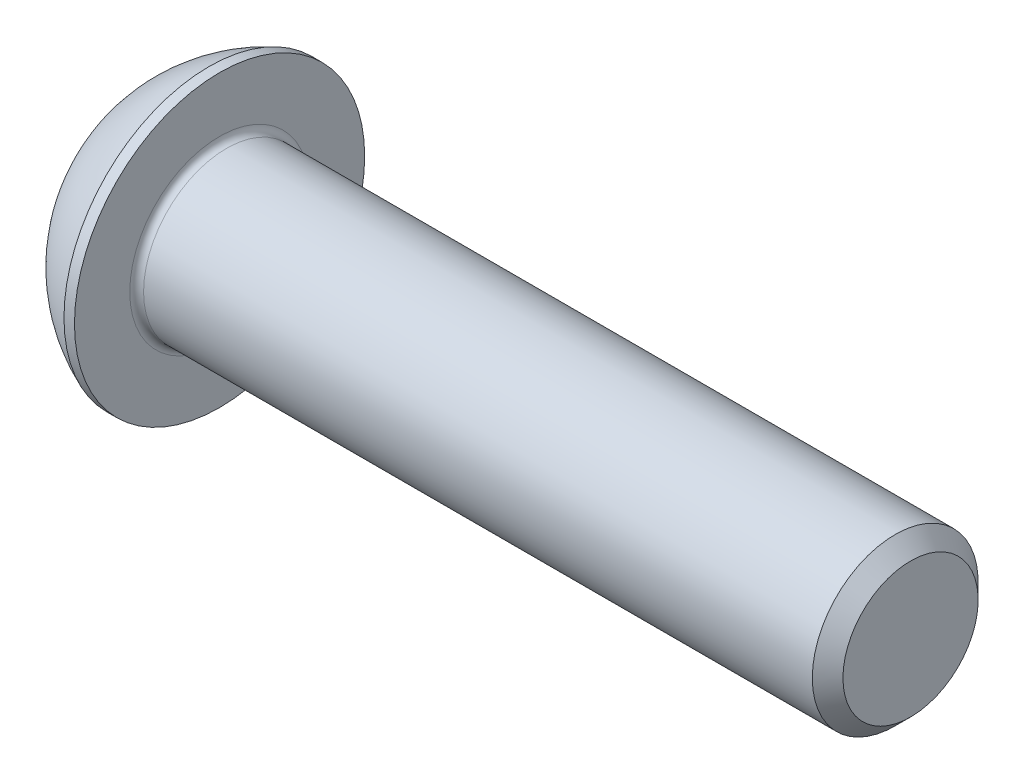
ISO-10303-21;
HEADER;
FILE_DESCRIPTION(('STEP AP214'),'2;1');
FILE_NAME('part.step','',(''),(''),'','','');
FILE_SCHEMA(('AUTOMOTIVE_DESIGN { 1 0 10303 214 1 1 1 1 }'));
ENDSEC;
DATA;
#1=APPLICATION_CONTEXT('core data for automotive mechanical design processes');
#2=APPLICATION_PROTOCOL_DEFINITION('international standard','automotive_design',2000,#1);
#3=PRODUCT_CONTEXT('',#1,'mechanical');
#4=PRODUCT('Part','Part','',(#3));
#5=PRODUCT_RELATED_PRODUCT_CATEGORY('part','',(#4));
#6=PRODUCT_DEFINITION_FORMATION('','',#4);
#7=PRODUCT_DEFINITION_CONTEXT('part definition',#1,'design');
#8=PRODUCT_DEFINITION('design','',#6,#7);
#9=PRODUCT_DEFINITION_SHAPE('','',#8);
#10=(LENGTH_UNIT() NAMED_UNIT(*) SI_UNIT(.MILLI.,.METRE.));
#11=(NAMED_UNIT(*) PLANE_ANGLE_UNIT() SI_UNIT($,.RADIAN.));
#12=(NAMED_UNIT(*) SI_UNIT($,.STERADIAN.) SOLID_ANGLE_UNIT());
#13=UNCERTAINTY_MEASURE_WITH_UNIT(LENGTH_MEASURE(1.E-05),#10,'distance_accuracy_value','');
#14=(GEOMETRIC_REPRESENTATION_CONTEXT(3) GLOBAL_UNCERTAINTY_ASSIGNED_CONTEXT((#13)) GLOBAL_UNIT_ASSIGNED_CONTEXT((#10,
#11,#12)) REPRESENTATION_CONTEXT('',''));
#15=CARTESIAN_POINT('',(0.,0.,0.));
#16=DIRECTION('',(0.,0.,1.));
#17=DIRECTION('',(1.,0.,0.));
#18=AXIS2_PLACEMENT_3D('',#15,#16,#17);
#19=CARTESIAN_POINT('',(0.,0.,0.));
#20=DIRECTION('',(-1.,0.,0.));
#21=DIRECTION('',(0.,0.,1.));
#22=AXIS2_PLACEMENT_3D('',#19,#20,#21);
#23=PLANE('',#22);
#24=CARTESIAN_POINT('',(0.,0.,0.));
#25=DIRECTION('',(-1.,0.,0.));
#26=DIRECTION('',(0.,0.,1.));
#27=AXIS2_PLACEMENT_3D('',#24,#25,#26);
#28=CIRCLE('',#27,2.625);
#29=CARTESIAN_POINT('',(0.,2.625,0.));
#30=VERTEX_POINT('',#29);
#31=EDGE_CURVE('E162',#30,#30,#28,.T.);
#32=ORIENTED_EDGE('',*,*,#31,.T.);
#33=EDGE_LOOP('',(#32));
#34=FACE_BOUND('',#33,.T.);
#35=DIRECTION('',(0.,-1.,0.));
#36=VECTOR('',#35,1.);
#37=CARTESIAN_POINT('',(0.,-1.15470053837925,2.));
#38=LINE('',#37,#36);
#39=CARTESIAN_POINT('',(0.,1.15470053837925,2.));
#40=VERTEX_POINT('',#39);
#41=CARTESIAN_POINT('',(0.,-1.15470053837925,2.));
#42=VERTEX_POINT('',#41);
#43=EDGE_CURVE('E52',#40,#42,#38,.T.);
#44=ORIENTED_EDGE('',*,*,#43,.T.);
#45=DIRECTION('',(0.,-0.5,-0.866025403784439));
#46=VECTOR('',#45,1.);
#47=CARTESIAN_POINT('',(0.,-2.3094010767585,0.));
#48=LINE('',#47,#46);
#49=CARTESIAN_POINT('',(0.,-2.3094010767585,0.));
#50=VERTEX_POINT('',#49);
#51=EDGE_CURVE('E255',#42,#50,#48,.T.);
#52=ORIENTED_EDGE('',*,*,#51,.T.);
#53=DIRECTION('',(0.,0.5,-0.866025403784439));
#54=VECTOR('',#53,1.);
#55=CARTESIAN_POINT('',(0.,-1.15470053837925,-2.));
#56=LINE('',#55,#54);
#57=CARTESIAN_POINT('',(0.,-1.15470053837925,-2.));
#58=VERTEX_POINT('',#57);
#59=EDGE_CURVE('E137',#50,#58,#56,.T.);
#60=ORIENTED_EDGE('',*,*,#59,.T.);
#61=DIRECTION('',(0.,1.,0.));
#62=VECTOR('',#61,1.);
#63=CARTESIAN_POINT('',(0.,1.15470053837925,-2.));
#64=LINE('',#63,#62);
#65=CARTESIAN_POINT('',(0.,1.15470053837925,-2.));
#66=VERTEX_POINT('',#65);
#67=EDGE_CURVE('E258',#58,#66,#64,.T.);
#68=ORIENTED_EDGE('',*,*,#67,.T.);
#69=DIRECTION('',(0.,0.5,0.866025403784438));
#70=VECTOR('',#69,1.);
#71=CARTESIAN_POINT('',(0.,2.3094010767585,0.));
#72=LINE('',#71,#70);
#73=CARTESIAN_POINT('',(0.,2.3094010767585,0.));
#74=VERTEX_POINT('',#73);
#75=EDGE_CURVE('E260',#66,#74,#72,.T.);
#76=ORIENTED_EDGE('',*,*,#75,.T.);
#77=DIRECTION('',(0.,-0.5,0.866025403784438));
#78=VECTOR('',#77,1.);
#79=CARTESIAN_POINT('',(0.,1.15470053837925,2.));
#80=LINE('',#79,#78);
#81=EDGE_CURVE('E262',#74,#40,#80,.T.);
#82=ORIENTED_EDGE('',*,*,#81,.T.);
#83=EDGE_LOOP('',(#44,#52,#60,#68,#76,#82));
#84=FACE_BOUND('',#83,.T.);
#85=ADVANCED_FACE('F37',(#34,#84),#23,.T.);
#86=CARTESIAN_POINT('',(4.99970462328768,0.,0.));
#87=DIRECTION('',(-1.,0.,0.));
#88=DIRECTION('',(0.,1.,0.));
#89=AXIS2_PLACEMENT_3D('',#86,#87,#88);
#90=SPHERICAL_SURFACE('',#89,5.64691697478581);
#91=CARTESIAN_POINT('',(2.92,0.,0.));
#92=DIRECTION('',(-1.,0.,0.));
#93=DIRECTION('',(0.,0.,1.));
#94=AXIS2_PLACEMENT_3D('',#91,#92,#93);
#95=CIRCLE('',#94,5.25);
#96=CARTESIAN_POINT('',(2.92,5.25,0.));
#97=VERTEX_POINT('',#96);
#98=EDGE_CURVE('E159',#97,#97,#95,.T.);
#99=CARTESIAN_POINT('',(2.92,5.25,0.));
#100=CARTESIAN_POINT('',(2.88116333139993,5.23461555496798,0.));
#101=CARTESIAN_POINT('',(2.84249743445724,5.21880002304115,0.));
#102=CARTESIAN_POINT('',(2.76552608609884,5.18631490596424,0.));
#103=CARTESIAN_POINT('',(2.72722063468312,5.16964532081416,0.));
#104=CARTESIAN_POINT('',(2.65098907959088,5.13546021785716,0.));
#105=CARTESIAN_POINT('',(2.61306297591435,5.11794470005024,0.));
#106=CARTESIAN_POINT('',(2.5376087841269,5.08207638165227,0.));
#107=CARTESIAN_POINT('',(2.50008069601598,5.06372358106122,0.));
#108=CARTESIAN_POINT('',(2.42544101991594,5.02618972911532,0.));
#109=CARTESIAN_POINT('',(2.38832943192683,5.00700867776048,0.));
#110=CARTESIAN_POINT('',(2.31454103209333,4.9678277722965,0.));
#111=CARTESIAN_POINT('',(2.27786422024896,4.94782791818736,0.));
#112=CARTESIAN_POINT('',(2.204963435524,4.90701925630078,0.));
#113=CARTESIAN_POINT('',(2.16873946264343,4.88621044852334,0.));
#114=CARTESIAN_POINT('',(2.09676219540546,4.84379412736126,0.));
#115=CARTESIAN_POINT('',(2.06100890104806,4.82218661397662,0.));
#116=CARTESIAN_POINT('',(1.9899905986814,4.77818352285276,0.));
#117=CARTESIAN_POINT('',(1.95472559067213,4.75578794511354,0.));
#118=CARTESIAN_POINT('',(1.88470122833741,4.7102197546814,0.));
#119=CARTESIAN_POINT('',(1.84994187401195,4.68704714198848,0.));
#120=CARTESIAN_POINT('',(1.78094593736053,4.63993629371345,0.));
#121=CARTESIAN_POINT('',(1.74670935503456,4.61599805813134,0.));
#122=CARTESIAN_POINT('',(1.67877582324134,4.56736775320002,0.));
#123=CARTESIAN_POINT('',(1.6450788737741,4.54267568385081,0.));
#124=CARTESIAN_POINT('',(1.57824120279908,4.4925498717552,0.));
#125=CARTESIAN_POINT('',(1.54510048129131,4.4671161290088,0.));
#126=CARTESIAN_POINT('',(1.4793915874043,4.4155194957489,0.));
#127=CARTESIAN_POINT('',(1.44682341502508,4.38935660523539,0.));
#128=CARTESIAN_POINT('',(1.3822756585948,4.33631456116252,0.));
#129=CARTESIAN_POINT('',(1.35029607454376,4.30943540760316,0.));
#130=CARTESIAN_POINT('',(1.28694124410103,4.2549740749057,0.));
#131=CARTESIAN_POINT('',(1.25556599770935,4.22739189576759,0.));
#132=CARTESIAN_POINT('',(1.19343529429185,4.17153809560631,0.));
#133=CARTESIAN_POINT('',(1.16267983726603,4.14326647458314,0.));
#134=CARTESIAN_POINT('',(1.10180385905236,4.0860477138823,0.));
#135=CARTESIAN_POINT('',(1.07168333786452,4.05710057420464,0.));
#136=CARTESIAN_POINT('',(1.01209206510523,3.99854503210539,0.));
#137=CARTESIAN_POINT('',(0.982621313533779,3.96893662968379,0.));
#138=CARTESIAN_POINT('',(0.924344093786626,3.90907314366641,0.));
#139=CARTESIAN_POINT('',(0.89553762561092,3.87881806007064,0.));
#140=CARTESIAN_POINT('',(0.838603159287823,3.8176761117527,0.));
#141=CARTESIAN_POINT('',(0.810475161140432,3.78678924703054,0.));
#142=CARTESIAN_POINT('',(0.754911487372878,3.72439894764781,0.));
#143=CARTESIAN_POINT('',(0.727475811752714,3.69289551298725,0.));
#144=CARTESIAN_POINT('',(0.673310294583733,3.62928758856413,0.));
#145=CARTESIAN_POINT('',(0.646580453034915,3.59718309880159,0.));
#146=CARTESIAN_POINT('',(0.59383976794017,3.53238887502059,0.));
#147=CARTESIAN_POINT('',(0.567828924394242,3.49969914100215,0.));
#148=CARTESIAN_POINT('',(0.516539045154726,3.43375052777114,0.));
#149=CARTESIAN_POINT('',(0.491260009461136,3.40049164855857,0.));
#150=CARTESIAN_POINT('',(0.441446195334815,3.33342112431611,0.));
#151=CARTESIAN_POINT('',(0.416911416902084,3.29960947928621,0.));
#152=CARTESIAN_POINT('',(0.368598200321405,3.23145007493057,0.));
#153=CARTESIAN_POINT('',(0.344819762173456,3.19710231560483,0.));
#154=CARTESIAN_POINT('',(0.298030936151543,3.12788759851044,0.));
#155=CARTESIAN_POINT('',(0.275020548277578,3.09302064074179,0.));
#156=CARTESIAN_POINT('',(0.229779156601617,3.02278469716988,0.));
#157=CARTESIAN_POINT('',(0.207548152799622,2.98741571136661,0.));
#158=CARTESIAN_POINT('',(0.163876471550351,2.91619313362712,0.));
#159=CARTESIAN_POINT('',(0.142435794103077,2.8803395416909,0.));
#160=CARTESIAN_POINT('',(0.100355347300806,2.80816539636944,0.));
#161=CARTESIAN_POINT('',(0.0797155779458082,2.7718448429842,0.));
#162=CARTESIAN_POINT('',(0.0392470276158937,2.69875470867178,0.));
#163=CARTESIAN_POINT('',(0.0194182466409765,2.66198512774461,0.));
#164=CARTESIAN_POINT('',(0.,2.625,0.));
#165=B_SPLINE_CURVE_WITH_KNOTS('',3,(#99,#100,#101,#102,#103,#104,#105,#106,#107,#108,#109,#110,
#111,#112,#113,#114,#115,#116,#117,#118,#119,#120,#121,#122,#123,#124,#125,#126,#127,#128,#129,
#130,#131,#132,#133,#134,#135,#136,#137,#138,#139,#140,#141,#142,#143,#144,#145,#146,#147,#148,
#149,#150,#151,#152,#153,#154,#155,#156,#157,#158,#159,#160,#161,#162,#163,#164),.UNSPECIFIED.,
.F.,.F.,(4,2,2,2,2,2,2,2,2,2,2,2,2,2,2,2,2,2,2,2,2,2,2,2,2,2,2,2,2,2,2,2,4),(0.,
0.12531586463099,0.25063172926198,0.37594759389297,0.50126345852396,0.626579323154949,
0.75189518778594,0.87721105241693,1.00252691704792,1.12784278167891,1.2531586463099,
1.37847451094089,1.50379037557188,1.62910624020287,1.75442210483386,1.87973796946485,
2.00505383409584,2.13036969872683,2.25568556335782,2.38100142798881,2.5063172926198,
2.63163315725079,2.75694902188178,2.88226488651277,3.00758075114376,3.13289661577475,
3.25821248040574,3.38352834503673,3.50884420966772,3.63416007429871,3.7594759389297,
3.88479180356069,4.01010766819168),.UNSPECIFIED.);
#166=EDGE_CURVE('BSEAM183',#97,#30,#165,.T.);
#167=ORIENTED_EDGE('',*,*,#98,.T.);
#168=ORIENTED_EDGE('',*,*,#31,.F.);
#169=ORIENTED_EDGE('',*,*,#166,.T.);
#170=ORIENTED_EDGE('',*,*,#166,.F.);
#171=EDGE_LOOP('',(#167,#169,#168,#170));
#172=FACE_BOUND('',#171,.T.);
#173=ADVANCED_FACE('F183',(#172),#90,.T.);
#174=CARTESIAN_POINT('',(0.,0.,0.));
#175=DIRECTION('',(-1.,0.,0.));
#176=DIRECTION('',(0.,0.,1.));
#177=AXIS2_PLACEMENT_3D('',#174,#175,#176);
#178=CYLINDRICAL_SURFACE('',#177,5.25);
#179=ORIENTED_EDGE('',*,*,#98,.F.);
#180=EDGE_LOOP('',(#179));
#181=FACE_BOUND('',#180,.T.);
#182=CARTESIAN_POINT('',(3.3,0.,0.));
#183=DIRECTION('',(-1.,0.,0.));
#184=DIRECTION('',(0.,0.,1.));
#185=AXIS2_PLACEMENT_3D('',#182,#183,#184);
#186=CIRCLE('',#185,5.25);
#187=CARTESIAN_POINT('',(3.3,0.,5.25));
#188=VERTEX_POINT('',#187);
#189=EDGE_CURVE('E156',#188,#188,#186,.T.);
#190=ORIENTED_EDGE('',*,*,#189,.T.);
#191=EDGE_LOOP('',(#190));
#192=FACE_BOUND('',#191,.T.);
#193=ADVANCED_FACE('F188',(#181,#192),#178,.T.);
#194=CARTESIAN_POINT('',(3.3,3.,0.));
#195=DIRECTION('',(-1.,0.,0.));
#196=DIRECTION('',(0.,0.,1.));
#197=AXIS2_PLACEMENT_3D('',#194,#195,#196);
#198=PLANE('',#197);
#199=CARTESIAN_POINT('',(3.3,0.,0.));
#200=DIRECTION('',(-1.,0.,0.));
#201=DIRECTION('',(0.,0.,1.));
#202=AXIS2_PLACEMENT_3D('',#199,#200,#201);
#203=CIRCLE('',#202,3.25);
#204=CARTESIAN_POINT('',(3.3,0.,3.25));
#205=VERTEX_POINT('',#204);
#206=EDGE_CURVE('E45',#205,#205,#203,.T.);
#207=ORIENTED_EDGE('',*,*,#206,.T.);
#208=EDGE_LOOP('',(#207));
#209=FACE_BOUND('',#208,.T.);
#210=ORIENTED_EDGE('',*,*,#189,.F.);
#211=EDGE_LOOP('',(#210));
#212=FACE_BOUND('',#211,.T.);
#213=ADVANCED_FACE('F167',(#209,#212),#198,.F.);
#214=CARTESIAN_POINT('',(0.,0.,0.));
#215=DIRECTION('',(-1.,0.,0.));
#216=DIRECTION('',(0.,0.,1.));
#217=AXIS2_PLACEMENT_3D('',#214,#215,#216);
#218=CYLINDRICAL_SURFACE('',#217,3.);
#219=CARTESIAN_POINT('',(3.55,0.,0.));
#220=DIRECTION('',(-1.,0.,0.));
#221=DIRECTION('',(0.,0.,1.));
#222=AXIS2_PLACEMENT_3D('',#219,#220,#221);
#223=CIRCLE('',#222,3.);
#224=CARTESIAN_POINT('',(3.55,0.,3.));
#225=VERTEX_POINT('',#224);
#226=EDGE_CURVE('E11',#225,#225,#223,.F.);
#227=ORIENTED_EDGE('',*,*,#226,.T.);
#228=EDGE_LOOP('',(#227));
#229=FACE_BOUND('',#228,.T.);
#230=CARTESIAN_POINT('',(27.7455,0.,0.));
#231=DIRECTION('',(-1.,0.,0.));
#232=DIRECTION('',(0.,0.,1.));
#233=AXIS2_PLACEMENT_3D('',#230,#231,#232);
#234=CIRCLE('',#233,3.);
#235=CARTESIAN_POINT('',(27.7455,0.,3.));
#236=VERTEX_POINT('',#235);
#237=EDGE_CURVE('E153',#236,#236,#234,.T.);
#238=ORIENTED_EDGE('',*,*,#237,.T.);
#239=EDGE_LOOP('',(#238));
#240=FACE_BOUND('',#239,.T.);
#241=ADVANCED_FACE('F197',(#229,#240),#218,.T.);
#242=CARTESIAN_POINT('',(28.3,0.,0.));
#243=DIRECTION('',(-1.,0.,0.));
#244=DIRECTION('',(0.,0.,1.));
#245=AXIS2_PLACEMENT_3D('',#242,#243,#244);
#246=CONICAL_SURFACE('',#245,2.4455,0.785398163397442);
#247=ORIENTED_EDGE('',*,*,#237,.F.);
#248=EDGE_LOOP('',(#247));
#249=FACE_BOUND('',#248,.T.);
#250=CARTESIAN_POINT('',(28.3,0.,0.));
#251=DIRECTION('',(-1.,0.,0.));
#252=DIRECTION('',(0.,0.,1.));
#253=AXIS2_PLACEMENT_3D('',#250,#251,#252);
#254=CIRCLE('',#253,2.4455);
#255=CARTESIAN_POINT('',(28.3,0.,2.4455));
#256=VERTEX_POINT('',#255);
#257=EDGE_CURVE('E149',#256,#256,#254,.T.);
#258=ORIENTED_EDGE('',*,*,#257,.T.);
#259=EDGE_LOOP('',(#258));
#260=FACE_BOUND('',#259,.T.);
#261=ADVANCED_FACE('F178',(#249,#260),#246,.T.);
#262=CARTESIAN_POINT('',(28.3,0.,0.));
#263=DIRECTION('',(-1.,0.,0.));
#264=DIRECTION('',(0.,0.,1.));
#265=AXIS2_PLACEMENT_3D('',#262,#263,#264);
#266=PLANE('',#265);
#267=ORIENTED_EDGE('',*,*,#257,.F.);
#268=EDGE_LOOP('',(#267));
#269=FACE_BOUND('',#268,.T.);
#270=ADVANCED_FACE('F171',(#269),#266,.F.);
#271=CARTESIAN_POINT('',(3.55,0.,0.));
#272=DIRECTION('',(-1.,0.,0.));
#273=DIRECTION('',(0.,0.,1.));
#274=AXIS2_PLACEMENT_3D('',#271,#272,#273);
#275=TOROIDAL_SURFACE('',#274,3.25,0.25);
#276=ORIENTED_EDGE('',*,*,#226,.F.);
#277=EDGE_LOOP('',(#276));
#278=FACE_BOUND('',#277,.T.);
#279=ORIENTED_EDGE('',*,*,#206,.F.);
#280=EDGE_LOOP('',(#279));
#281=FACE_BOUND('',#280,.T.);
#282=ADVANCED_FACE('F39',(#278,#281),#275,.F.);
#283=CARTESIAN_POINT('',(2.08,-2.3094010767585,0.));
#284=DIRECTION('',(0.,0.866025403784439,-0.5));
#285=DIRECTION('',(0.,0.5,0.866025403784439));
#286=AXIS2_PLACEMENT_3D('',#283,#284,#285);
#287=PLANE('',#286);
#288=DIRECTION('',(0.,-0.5,-0.866025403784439));
#289=VECTOR('',#288,1.);
#290=CARTESIAN_POINT('',(2.08,-2.3094010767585,0.));
#291=LINE('',#290,#289);
#292=CARTESIAN_POINT('',(2.08,-1.15470053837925,2.));
#293=VERTEX_POINT('',#292);
#294=CARTESIAN_POINT('',(2.08,-1.73205080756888,0.999999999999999));
#295=VERTEX_POINT('',#294);
#296=EDGE_CURVE('E120',#293,#295,#291,.T.);
#297=ORIENTED_EDGE('',*,*,#296,.T.);
#298=CARTESIAN_POINT('',(2.08,-2.3094010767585,0.));
#299=VERTEX_POINT('',#298);
#300=EDGE_CURVE('E113',#295,#299,#291,.T.);
#301=ORIENTED_EDGE('',*,*,#300,.T.);
#302=DIRECTION('',(-1.,0.,0.));
#303=VECTOR('',#302,1.);
#304=CARTESIAN_POINT('',(2.08,-2.3094010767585,0.));
#305=LINE('',#304,#303);
#306=EDGE_CURVE('E117',#299,#50,#305,.T.);
#307=ORIENTED_EDGE('',*,*,#306,.T.);
#308=ORIENTED_EDGE('',*,*,#51,.F.);
#309=DIRECTION('',(-1.,0.,0.));
#310=VECTOR('',#309,1.);
#311=CARTESIAN_POINT('',(2.08,-1.15470053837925,2.));
#312=LINE('',#311,#310);
#313=EDGE_CURVE('E245',#293,#42,#312,.T.);
#314=ORIENTED_EDGE('',*,*,#313,.F.);
#315=EDGE_LOOP('',(#297,#301,#307,#308,#314));
#316=FACE_BOUND('',#315,.T.);
#317=ADVANCED_FACE('F115',(#316),#287,.T.);
#318=CARTESIAN_POINT('',(2.08,-1.15470053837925,-2.));
#319=DIRECTION('',(0.,0.866025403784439,0.5));
#320=DIRECTION('',(0.,-0.5,0.866025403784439));
#321=AXIS2_PLACEMENT_3D('',#318,#319,#320);
#322=PLANE('',#321);
#323=DIRECTION('',(0.,0.5,-0.866025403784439));
#324=VECTOR('',#323,1.);
#325=CARTESIAN_POINT('',(2.08,-1.15470053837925,-2.));
#326=LINE('',#325,#324);
#327=CARTESIAN_POINT('',(2.08,-1.73205080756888,-0.999999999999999));
#328=VERTEX_POINT('',#327);
#329=EDGE_CURVE('E125',#299,#328,#326,.T.);
#330=ORIENTED_EDGE('',*,*,#329,.T.);
#331=CARTESIAN_POINT('',(2.08,-1.15470053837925,-2.));
#332=VERTEX_POINT('',#331);
#333=EDGE_CURVE('E132',#328,#332,#326,.T.);
#334=ORIENTED_EDGE('',*,*,#333,.T.);
#335=DIRECTION('',(-1.,0.,0.));
#336=VECTOR('',#335,1.);
#337=CARTESIAN_POINT('',(2.08,-1.15470053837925,-2.));
#338=LINE('',#337,#336);
#339=EDGE_CURVE('E139',#332,#58,#338,.T.);
#340=ORIENTED_EDGE('',*,*,#339,.T.);
#341=ORIENTED_EDGE('',*,*,#59,.F.);
#342=ORIENTED_EDGE('',*,*,#306,.F.);
#343=EDGE_LOOP('',(#330,#334,#340,#341,#342));
#344=FACE_BOUND('',#343,.T.);
#345=ADVANCED_FACE('F135',(#344),#322,.T.);
#346=CARTESIAN_POINT('',(2.08,1.15470053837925,-2.));
#347=DIRECTION('',(0.,0.,1.));
#348=DIRECTION('',(1.,0.,0.));
#349=AXIS2_PLACEMENT_3D('',#346,#347,#348);
#350=PLANE('',#349);
#351=DIRECTION('',(0.,1.,0.));
#352=VECTOR('',#351,1.);
#353=CARTESIAN_POINT('',(2.08,1.15470053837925,-2.));
#354=LINE('',#353,#352);
#355=CARTESIAN_POINT('',(2.08,0.,-2.));
#356=VERTEX_POINT('',#355);
#357=EDGE_CURVE('E281',#332,#356,#354,.T.);
#358=ORIENTED_EDGE('',*,*,#357,.T.);
#359=CARTESIAN_POINT('',(2.08,1.15470053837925,-2.));
#360=VERTEX_POINT('',#359);
#361=EDGE_CURVE('E131',#356,#360,#354,.T.);
#362=ORIENTED_EDGE('',*,*,#361,.T.);
#363=DIRECTION('',(-1.,0.,0.));
#364=VECTOR('',#363,1.);
#365=CARTESIAN_POINT('',(2.08,1.15470053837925,-2.));
#366=LINE('',#365,#364);
#367=EDGE_CURVE('E144',#360,#66,#366,.T.);
#368=ORIENTED_EDGE('',*,*,#367,.T.);
#369=ORIENTED_EDGE('',*,*,#67,.F.);
#370=ORIENTED_EDGE('',*,*,#339,.F.);
#371=EDGE_LOOP('',(#358,#362,#368,#369,#370));
#372=FACE_BOUND('',#371,.T.);
#373=ADVANCED_FACE('F211',(#372),#350,.T.);
#374=CARTESIAN_POINT('',(2.08,2.3094010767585,0.));
#375=DIRECTION('',(0.,-0.866025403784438,0.5));
#376=DIRECTION('',(0.,-0.5,-0.866025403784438));
#377=AXIS2_PLACEMENT_3D('',#374,#375,#376);
#378=PLANE('',#377);
#379=DIRECTION('',(0.,0.5,0.866025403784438));
#380=VECTOR('',#379,1.);
#381=CARTESIAN_POINT('',(2.08,2.3094010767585,0.));
#382=LINE('',#381,#380);
#383=CARTESIAN_POINT('',(2.08,1.73205080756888,-1.));
#384=VERTEX_POINT('',#383);
#385=EDGE_CURVE('E287',#360,#384,#382,.T.);
#386=ORIENTED_EDGE('',*,*,#385,.T.);
#387=CARTESIAN_POINT('',(2.08,2.3094010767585,0.));
#388=VERTEX_POINT('',#387);
#389=EDGE_CURVE('E285',#384,#388,#382,.T.);
#390=ORIENTED_EDGE('',*,*,#389,.T.);
#391=DIRECTION('',(-1.,0.,0.));
#392=VECTOR('',#391,1.);
#393=CARTESIAN_POINT('',(2.08,2.3094010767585,0.));
#394=LINE('',#393,#392);
#395=EDGE_CURVE('E267',#388,#74,#394,.T.);
#396=ORIENTED_EDGE('',*,*,#395,.T.);
#397=ORIENTED_EDGE('',*,*,#75,.F.);
#398=ORIENTED_EDGE('',*,*,#367,.F.);
#399=EDGE_LOOP('',(#386,#390,#396,#397,#398));
#400=FACE_BOUND('',#399,.T.);
#401=ADVANCED_FACE('F214',(#400),#378,.T.);
#402=CARTESIAN_POINT('',(2.08,1.15470053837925,2.));
#403=DIRECTION('',(0.,-0.866025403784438,-0.5));
#404=DIRECTION('',(0.,0.5,-0.866025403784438));
#405=AXIS2_PLACEMENT_3D('',#402,#403,#404);
#406=PLANE('',#405);
#407=DIRECTION('',(0.,-0.5,0.866025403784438));
#408=VECTOR('',#407,1.);
#409=CARTESIAN_POINT('',(2.08,1.15470053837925,2.));
#410=LINE('',#409,#408);
#411=CARTESIAN_POINT('',(2.08,1.73205080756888,1.));
#412=VERTEX_POINT('',#411);
#413=EDGE_CURVE('E251',#388,#412,#410,.T.);
#414=ORIENTED_EDGE('',*,*,#413,.T.);
#415=CARTESIAN_POINT('',(2.08,1.15470053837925,2.));
#416=VERTEX_POINT('',#415);
#417=EDGE_CURVE('E243',#412,#416,#410,.T.);
#418=ORIENTED_EDGE('',*,*,#417,.T.);
#419=DIRECTION('',(-1.,0.,0.));
#420=VECTOR('',#419,1.);
#421=CARTESIAN_POINT('',(2.08,1.15470053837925,2.));
#422=LINE('',#421,#420);
#423=EDGE_CURVE('E249',#416,#40,#422,.T.);
#424=ORIENTED_EDGE('',*,*,#423,.T.);
#425=ORIENTED_EDGE('',*,*,#81,.F.);
#426=ORIENTED_EDGE('',*,*,#395,.F.);
#427=EDGE_LOOP('',(#414,#418,#424,#425,#426));
#428=FACE_BOUND('',#427,.T.);
#429=ADVANCED_FACE('F218',(#428),#406,.T.);
#430=CARTESIAN_POINT('',(2.08,-1.15470053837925,2.));
#431=DIRECTION('',(0.,0.,-1.));
#432=DIRECTION('',(-1.,0.,0.));
#433=AXIS2_PLACEMENT_3D('',#430,#431,#432);
#434=PLANE('',#433);
#435=DIRECTION('',(0.,-1.,0.));
#436=VECTOR('',#435,1.);
#437=CARTESIAN_POINT('',(2.08,-1.15470053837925,2.));
#438=LINE('',#437,#436);
#439=CARTESIAN_POINT('',(2.08,0.,2.));
#440=VERTEX_POINT('',#439);
#441=EDGE_CURVE('E60',#416,#440,#438,.T.);
#442=ORIENTED_EDGE('',*,*,#441,.T.);
#443=EDGE_CURVE('E246',#440,#293,#438,.T.);
#444=ORIENTED_EDGE('',*,*,#443,.T.);
#445=ORIENTED_EDGE('',*,*,#313,.T.);
#446=ORIENTED_EDGE('',*,*,#43,.F.);
#447=ORIENTED_EDGE('',*,*,#423,.F.);
#448=EDGE_LOOP('',(#442,#444,#445,#446,#447));
#449=FACE_BOUND('',#448,.T.);
#450=ADVANCED_FACE('F222',(#449),#434,.T.);
#451=CARTESIAN_POINT('',(2.08,-1.15470053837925,2.));
#452=DIRECTION('',(-1.,0.,0.));
#453=DIRECTION('',(0.,0.,1.));
#454=AXIS2_PLACEMENT_3D('',#451,#452,#453);
#455=PLANE('',#454);
#456=ORIENTED_EDGE('',*,*,#441,.F.);
#457=ORIENTED_EDGE('',*,*,#417,.F.);
#458=CARTESIAN_POINT('',(2.08,0.,0.));
#459=DIRECTION('',(-1.,0.,0.));
#460=DIRECTION('',(0.,0.,1.));
#461=AXIS2_PLACEMENT_3D('',#458,#459,#460);
#462=CIRCLE('',#461,2.);
#463=EDGE_CURVE('E143',#440,#412,#462,.T.);
#464=ORIENTED_EDGE('',*,*,#463,.F.);
#465=EDGE_LOOP('',(#456,#457,#464));
#466=FACE_BOUND('',#465,.T.);
#467=ADVANCED_FACE('F226',(#466),#455,.T.);
#468=ORIENTED_EDGE('',*,*,#413,.F.);
#469=ORIENTED_EDGE('',*,*,#389,.F.);
#470=EDGE_CURVE('E150',#412,#384,#462,.T.);
#471=ORIENTED_EDGE('',*,*,#470,.F.);
#472=EDGE_LOOP('',(#468,#469,#471));
#473=FACE_BOUND('',#472,.T.);
#474=ADVANCED_FACE('F234',(#473),#455,.T.);
#475=ORIENTED_EDGE('',*,*,#385,.F.);
#476=ORIENTED_EDGE('',*,*,#361,.F.);
#477=EDGE_CURVE('E292',#384,#356,#462,.T.);
#478=ORIENTED_EDGE('',*,*,#477,.F.);
#479=EDGE_LOOP('',(#475,#476,#478));
#480=FACE_BOUND('',#479,.T.);
#481=ADVANCED_FACE('F239',(#480),#455,.T.);
#482=ORIENTED_EDGE('',*,*,#357,.F.);
#483=ORIENTED_EDGE('',*,*,#333,.F.);
#484=EDGE_CURVE('E284',#356,#328,#462,.T.);
#485=ORIENTED_EDGE('',*,*,#484,.F.);
#486=EDGE_LOOP('',(#482,#483,#485));
#487=FACE_BOUND('',#486,.T.);
#488=ADVANCED_FACE('F232',(#487),#455,.T.);
#489=ORIENTED_EDGE('',*,*,#329,.F.);
#490=ORIENTED_EDGE('',*,*,#300,.F.);
#491=EDGE_CURVE('E127',#328,#295,#462,.T.);
#492=ORIENTED_EDGE('',*,*,#491,.F.);
#493=EDGE_LOOP('',(#489,#490,#492));
#494=FACE_BOUND('',#493,.T.);
#495=ADVANCED_FACE('F126',(#494),#455,.T.);
#496=ORIENTED_EDGE('',*,*,#296,.F.);
#497=ORIENTED_EDGE('',*,*,#443,.F.);
#498=EDGE_CURVE('E138',#295,#440,#462,.T.);
#499=ORIENTED_EDGE('',*,*,#498,.F.);
#500=EDGE_LOOP('',(#496,#497,#499));
#501=FACE_BOUND('',#500,.T.);
#502=ADVANCED_FACE('F206',(#501),#455,.T.);
#503=CARTESIAN_POINT('',(3.23470053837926,0.,0.));
#504=DIRECTION('',(-1.,0.,0.));
#505=DIRECTION('',(0.,0.,1.));
#506=AXIS2_PLACEMENT_3D('',#503,#504,#505);
#507=CONICAL_SURFACE('',#506,0.,1.04719755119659);
#508=ORIENTED_EDGE('',*,*,#463,.T.);
#509=ORIENTED_EDGE('',*,*,#470,.T.);
#510=ORIENTED_EDGE('',*,*,#477,.T.);
#511=ORIENTED_EDGE('',*,*,#484,.T.);
#512=ORIENTED_EDGE('',*,*,#491,.T.);
#513=ORIENTED_EDGE('',*,*,#498,.T.);
#514=EDGE_LOOP('',(#508,#509,#510,#511,#512,#513));
#515=FACE_BOUND('',#514,.T.);
#516=CARTESIAN_POINT('',(3.23470053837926,0.,0.));
#517=VERTEX_POINT('',#516);
#518=VERTEX_LOOP('',#517);
#519=FACE_BOUND('',#518,.T.);
#520=ADVANCED_FACE('F204',(#515,#519),#507,.F.);
#521=CLOSED_SHELL('',(#85,#173,#193,#213,#241,#261,#270,#282,#317,#345,#373,#401,#429,#450,#467,
#474,#481,#488,#495,#502,#520));
#522=MANIFOLD_SOLID_BREP('B2',#521);
#523=ADVANCED_BREP_SHAPE_REPRESENTATION('',(#18,#522),#14);
#524=SHAPE_DEFINITION_REPRESENTATION(#9,#523);
ENDSEC;
END-ISO-10303-21;
